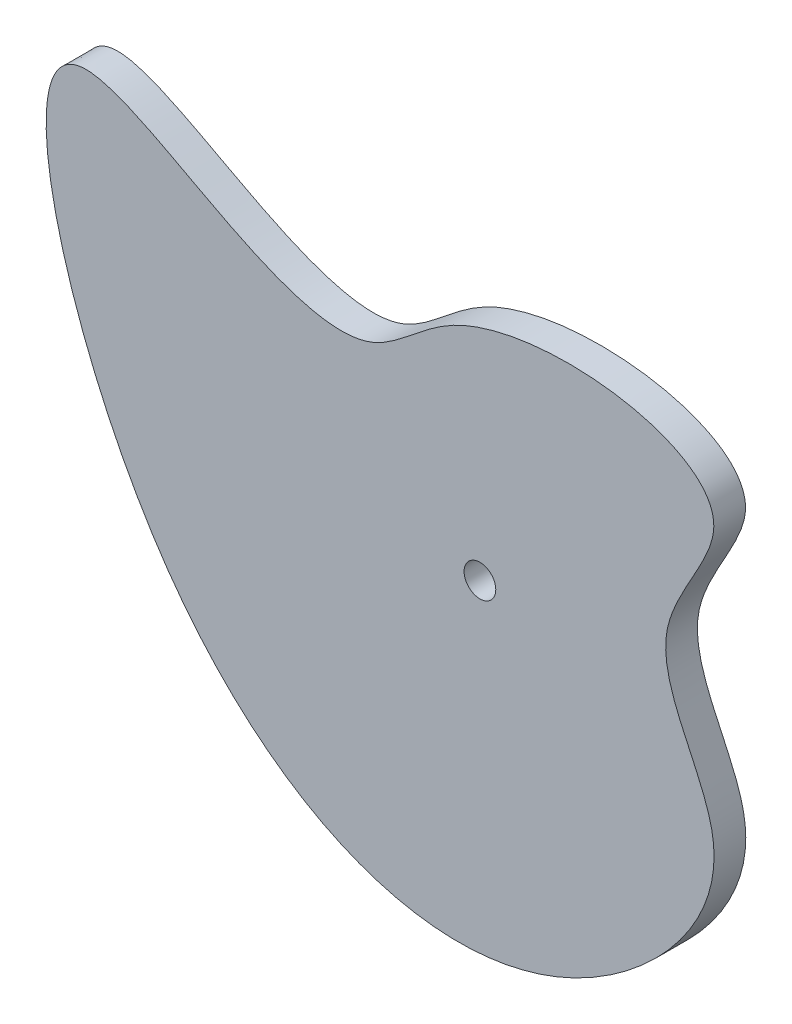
ISO-10303-21;
HEADER;
FILE_DESCRIPTION(('STEP AP214'),'2;1');
FILE_NAME('part.step','',(''),(''),'','','');
FILE_SCHEMA(('AUTOMOTIVE_DESIGN { 1 0 10303 214 1 1 1 1 }'));
ENDSEC;
DATA;
#1=APPLICATION_CONTEXT('core data for automotive mechanical design processes');
#2=APPLICATION_PROTOCOL_DEFINITION('international standard','automotive_design',2000,#1);
#3=PRODUCT_CONTEXT('',#1,'mechanical');
#4=PRODUCT('Part','Part','',(#3));
#5=PRODUCT_RELATED_PRODUCT_CATEGORY('part','',(#4));
#6=PRODUCT_DEFINITION_FORMATION('','',#4);
#7=PRODUCT_DEFINITION_CONTEXT('part definition',#1,'design');
#8=PRODUCT_DEFINITION('design','',#6,#7);
#9=PRODUCT_DEFINITION_SHAPE('','',#8);
#10=(LENGTH_UNIT() NAMED_UNIT(*) SI_UNIT(.MILLI.,.METRE.));
#11=(NAMED_UNIT(*) PLANE_ANGLE_UNIT() SI_UNIT($,.RADIAN.));
#12=(NAMED_UNIT(*) SI_UNIT($,.STERADIAN.) SOLID_ANGLE_UNIT());
#13=UNCERTAINTY_MEASURE_WITH_UNIT(LENGTH_MEASURE(1.E-05),#10,'distance_accuracy_value','');
#14=(GEOMETRIC_REPRESENTATION_CONTEXT(3) GLOBAL_UNCERTAINTY_ASSIGNED_CONTEXT((#13)) GLOBAL_UNIT_ASSIGNED_CONTEXT((#10,
#11,#12)) REPRESENTATION_CONTEXT('',''));
#15=CARTESIAN_POINT('',(0.,0.,0.));
#16=DIRECTION('',(0.,0.,1.));
#17=DIRECTION('',(1.,0.,0.));
#18=AXIS2_PLACEMENT_3D('',#15,#16,#17);
#19=CARTESIAN_POINT('',(-12.6596008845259,-30.3398684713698,3.175));
#20=DIRECTION('',(0.,0.,-1.));
#21=DIRECTION('',(-1.,0.,0.));
#22=AXIS2_PLACEMENT_3D('',#19,#20,#21);
#23=PLANE('',#22);
#24=CARTESIAN_POINT('',(-2.66264114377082,20.8153139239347,3.175));
#25=CARTESIAN_POINT('',(-6.02677030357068,19.0337283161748,3.175));
#26=CARTESIAN_POINT('',(-14.6663497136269,7.80480855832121,3.175));
#27=CARTESIAN_POINT('',(-52.2352677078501,41.9015776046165,3.175));
#28=CARTESIAN_POINT('',(-34.9729890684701,-26.0987995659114,3.175));
#29=CARTESIAN_POINT('',(5.30603884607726,-39.786823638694,3.175));
#30=CARTESIAN_POINT('',(28.9328639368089,-12.2208883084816,3.175));
#31=CARTESIAN_POINT('',(14.1947538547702,3.42219559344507,3.175));
#32=CARTESIAN_POINT('',(31.7574875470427,22.0916236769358,3.175));
#33=CARTESIAN_POINT('',(6.23017532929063,25.524798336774,3.175));
#34=CARTESIAN_POINT('',(-2.66264114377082,20.8153139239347,3.175));
#35=B_SPLINE_CURVE_WITH_KNOTS('',3,(#24,#25,#26,#27,#28,#29,#30,#31,#32,#33,#34),.UNSPECIFIED.,
.T.,.F.,(4,1,1,1,1,1,1,1,4),(0.,0.0495675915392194,0.199465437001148,0.394943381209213,
0.620576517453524,0.727085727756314,0.807748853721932,0.868971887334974,1.),.UNSPECIFIED.);
#36=CARTESIAN_POINT('',(-2.66264114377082,20.8153139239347,3.175));
#37=VERTEX_POINT('',#36);
#38=EDGE_CURVE('E10',#37,#37,#35,.T.);
#39=ORIENTED_EDGE('',*,*,#38,.T.);
#40=EDGE_LOOP('',(#39));
#41=FACE_BOUND('',#40,.T.);
#42=CARTESIAN_POINT('',(0.,0.,3.175));
#43=DIRECTION('',(0.,0.,1.));
#44=DIRECTION('',(1.,0.,0.));
#45=AXIS2_PLACEMENT_3D('',#42,#43,#44);
#46=CIRCLE('',#45,1.5875);
#47=CARTESIAN_POINT('',(1.5875,0.,3.175));
#48=VERTEX_POINT('',#47);
#49=EDGE_CURVE('E44',#48,#48,#46,.T.);
#50=ORIENTED_EDGE('',*,*,#49,.F.);
#51=EDGE_LOOP('',(#50));
#52=FACE_BOUND('',#51,.T.);
#53=ADVANCED_FACE('F31',(#41,#52),#23,.F.);
#54=CARTESIAN_POINT('',(-12.6596008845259,-30.3398684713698,0.));
#55=DIRECTION('',(0.,0.,-1.));
#56=DIRECTION('',(-1.,0.,0.));
#57=AXIS2_PLACEMENT_3D('',#54,#55,#56);
#58=PLANE('',#57);
#59=CARTESIAN_POINT('',(-2.66264114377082,20.8153139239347,0.));
#60=CARTESIAN_POINT('',(-6.02677030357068,19.0337283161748,0.));
#61=CARTESIAN_POINT('',(-14.6663497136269,7.80480855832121,0.));
#62=CARTESIAN_POINT('',(-52.2352677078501,41.9015776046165,0.));
#63=CARTESIAN_POINT('',(-34.9729890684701,-26.0987995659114,0.));
#64=CARTESIAN_POINT('',(5.30603884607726,-39.786823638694,0.));
#65=CARTESIAN_POINT('',(28.9328639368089,-12.2208883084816,0.));
#66=CARTESIAN_POINT('',(14.1947538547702,3.42219559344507,0.));
#67=CARTESIAN_POINT('',(31.7574875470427,22.0916236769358,0.));
#68=CARTESIAN_POINT('',(6.23017532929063,25.524798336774,0.));
#69=CARTESIAN_POINT('',(-2.66264114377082,20.8153139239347,0.));
#70=B_SPLINE_CURVE_WITH_KNOTS('',3,(#59,#60,#61,#62,#63,#64,#65,#66,#67,#68,#69),.UNSPECIFIED.,
.T.,.F.,(4,1,1,1,1,1,1,1,4),(0.,0.0495675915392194,0.199465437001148,0.394943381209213,
0.620576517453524,0.727085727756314,0.807748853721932,0.868971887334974,1.),.UNSPECIFIED.);
#71=CARTESIAN_POINT('',(-2.66264114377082,20.8153139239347,0.));
#72=VERTEX_POINT('',#71);
#73=EDGE_CURVE('E36',#72,#72,#70,.T.);
#74=ORIENTED_EDGE('',*,*,#73,.F.);
#75=EDGE_LOOP('',(#74));
#76=FACE_BOUND('',#75,.T.);
#77=CARTESIAN_POINT('',(0.,0.,0.));
#78=DIRECTION('',(0.,0.,1.));
#79=DIRECTION('',(1.,0.,0.));
#80=AXIS2_PLACEMENT_3D('',#77,#78,#79);
#81=CIRCLE('',#80,1.5875);
#82=CARTESIAN_POINT('',(1.5875,0.,0.));
#83=VERTEX_POINT('',#82);
#84=EDGE_CURVE('E49',#83,#83,#81,.T.);
#85=ORIENTED_EDGE('',*,*,#84,.T.);
#86=EDGE_LOOP('',(#85));
#87=FACE_BOUND('',#86,.T.);
#88=ADVANCED_FACE('F62',(#76,#87),#58,.T.);
#89=DIRECTION('',(0.,0.,-1.));
#90=VECTOR('',#89,1.);
#91=SURFACE_OF_LINEAR_EXTRUSION('',#35,#90);
#92=ORIENTED_EDGE('',*,*,#38,.F.);
#93=EDGE_LOOP('',(#92));
#94=FACE_BOUND('',#93,.T.);
#95=ORIENTED_EDGE('',*,*,#73,.T.);
#96=EDGE_LOOP('',(#95));
#97=FACE_BOUND('',#96,.T.);
#98=ADVANCED_FACE('F33',(#94,#97),#91,.F.);
#99=CARTESIAN_POINT('',(0.,0.,3.175));
#100=DIRECTION('',(0.,0.,-1.));
#101=DIRECTION('',(-1.,0.,0.));
#102=AXIS2_PLACEMENT_3D('',#99,#100,#101);
#103=CYLINDRICAL_SURFACE('',#102,1.5875);
#104=ORIENTED_EDGE('',*,*,#49,.T.);
#105=EDGE_LOOP('',(#104));
#106=FACE_BOUND('',#105,.T.);
#107=ORIENTED_EDGE('',*,*,#84,.F.);
#108=EDGE_LOOP('',(#107));
#109=FACE_BOUND('',#108,.T.);
#110=ADVANCED_FACE('F58',(#106,#109),#103,.F.);
#111=CLOSED_SHELL('',(#53,#88,#98,#110));
#112=MANIFOLD_SOLID_BREP('B2',#111);
#113=ADVANCED_BREP_SHAPE_REPRESENTATION('',(#18,#112),#14);
#114=SHAPE_DEFINITION_REPRESENTATION(#9,#113);
ENDSEC;
END-ISO-10303-21;
